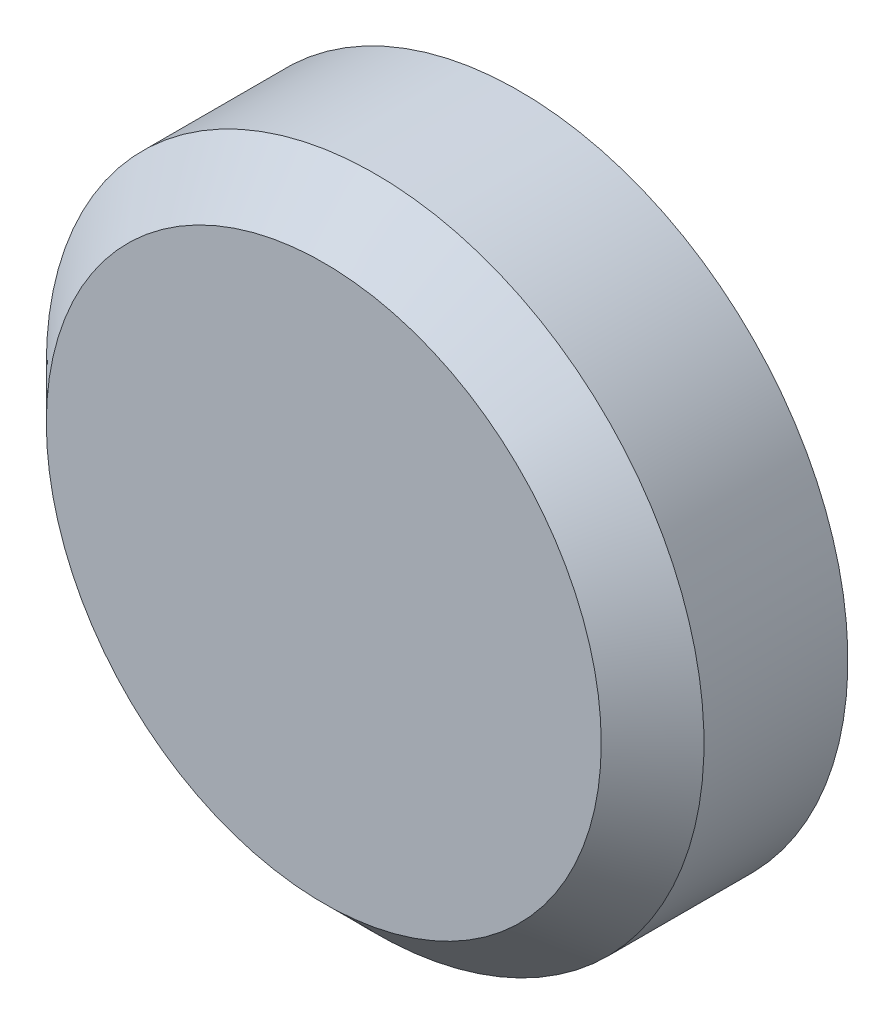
ISO-10303-21;
HEADER;
FILE_DESCRIPTION(('STEP AP214'),'2;1');
FILE_NAME('part.step','',(''),(''),'','','');
FILE_SCHEMA(('AUTOMOTIVE_DESIGN { 1 0 10303 214 1 1 1 1 }'));
ENDSEC;
DATA;
#1=APPLICATION_CONTEXT('core data for automotive mechanical design processes');
#2=APPLICATION_PROTOCOL_DEFINITION('international standard','automotive_design',2000,#1);
#3=PRODUCT_CONTEXT('',#1,'mechanical');
#4=PRODUCT('Part','Part','',(#3));
#5=PRODUCT_RELATED_PRODUCT_CATEGORY('part','',(#4));
#6=PRODUCT_DEFINITION_FORMATION('','',#4);
#7=PRODUCT_DEFINITION_CONTEXT('part definition',#1,'design');
#8=PRODUCT_DEFINITION('design','',#6,#7);
#9=PRODUCT_DEFINITION_SHAPE('','',#8);
#10=(LENGTH_UNIT() NAMED_UNIT(*) SI_UNIT(.MILLI.,.METRE.));
#11=(NAMED_UNIT(*) PLANE_ANGLE_UNIT() SI_UNIT($,.RADIAN.));
#12=(NAMED_UNIT(*) SI_UNIT($,.STERADIAN.) SOLID_ANGLE_UNIT());
#13=UNCERTAINTY_MEASURE_WITH_UNIT(LENGTH_MEASURE(1.E-05),#10,'distance_accuracy_value','');
#14=(GEOMETRIC_REPRESENTATION_CONTEXT(3) GLOBAL_UNCERTAINTY_ASSIGNED_CONTEXT((#13)) GLOBAL_UNIT_ASSIGNED_CONTEXT((#10,
#11,#12)) REPRESENTATION_CONTEXT('',''));
#15=CARTESIAN_POINT('',(0.,0.,0.));
#16=DIRECTION('',(0.,0.,1.));
#17=DIRECTION('',(1.,0.,0.));
#18=AXIS2_PLACEMENT_3D('',#15,#16,#17);
#19=CARTESIAN_POINT('',(0.,0.,1.9));
#20=DIRECTION('',(0.,0.,-1.));
#21=DIRECTION('',(-1.,0.,0.));
#22=AXIS2_PLACEMENT_3D('',#19,#20,#21);
#23=CYLINDRICAL_SURFACE('',#22,3.2);
#24=CARTESIAN_POINT('',(0.,0.,1.4));
#25=DIRECTION('',(0.,0.,1.));
#26=DIRECTION('',(1.,0.,0.));
#27=AXIS2_PLACEMENT_3D('',#24,#25,#26);
#28=CIRCLE('',#27,3.2);
#29=CARTESIAN_POINT('',(-3.2,0.,1.4));
#30=VERTEX_POINT('',#29);
#31=EDGE_CURVE('E10',#30,#30,#28,.F.);
#32=CARTESIAN_POINT('',(0.,0.,0.));
#33=DIRECTION('',(0.,0.,1.));
#34=DIRECTION('',(1.,0.,0.));
#35=AXIS2_PLACEMENT_3D('',#32,#33,#34);
#36=CIRCLE('',#35,3.2);
#37=CARTESIAN_POINT('',(-3.2,0.,0.));
#38=VERTEX_POINT('',#37);
#39=EDGE_CURVE('E41',#38,#38,#36,.T.);
#40=CARTESIAN_POINT('',(-3.2,0.,1.4));
#41=CARTESIAN_POINT('',(-3.2,0.,1.38541666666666));
#42=CARTESIAN_POINT('',(-3.2,0.,1.37083333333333));
#43=CARTESIAN_POINT('',(-3.2,0.,1.34166666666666));
#44=CARTESIAN_POINT('',(-3.2,0.,1.32708333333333));
#45=CARTESIAN_POINT('',(-3.2,0.,1.29791666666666));
#46=CARTESIAN_POINT('',(-3.2,0.,1.28333333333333));
#47=CARTESIAN_POINT('',(-3.2,0.,1.25416666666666));
#48=CARTESIAN_POINT('',(-3.2,0.,1.23958333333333));
#49=CARTESIAN_POINT('',(-3.2,0.,1.21041666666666));
#50=CARTESIAN_POINT('',(-3.2,0.,1.19583333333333));
#51=CARTESIAN_POINT('',(-3.2,0.,1.16666666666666));
#52=CARTESIAN_POINT('',(-3.2,0.,1.15208333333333));
#53=CARTESIAN_POINT('',(-3.2,0.,1.12291666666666));
#54=CARTESIAN_POINT('',(-3.2,0.,1.10833333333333));
#55=CARTESIAN_POINT('',(-3.2,0.,1.07916666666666));
#56=CARTESIAN_POINT('',(-3.2,0.,1.06458333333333));
#57=CARTESIAN_POINT('',(-3.2,0.,1.03541666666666));
#58=CARTESIAN_POINT('',(-3.2,0.,1.02083333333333));
#59=CARTESIAN_POINT('',(-3.2,0.,0.991666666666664));
#60=CARTESIAN_POINT('',(-3.2,0.,0.977083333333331));
#61=CARTESIAN_POINT('',(-3.2,0.,0.947916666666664));
#62=CARTESIAN_POINT('',(-3.2,0.,0.933333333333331));
#63=CARTESIAN_POINT('',(-3.2,0.,0.904166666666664));
#64=CARTESIAN_POINT('',(-3.2,0.,0.889583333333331));
#65=CARTESIAN_POINT('',(-3.2,0.,0.860416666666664));
#66=CARTESIAN_POINT('',(-3.2,0.,0.845833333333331));
#67=CARTESIAN_POINT('',(-3.2,0.,0.816666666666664));
#68=CARTESIAN_POINT('',(-3.2,0.,0.802083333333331));
#69=CARTESIAN_POINT('',(-3.2,0.,0.772916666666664));
#70=CARTESIAN_POINT('',(-3.2,0.,0.758333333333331));
#71=CARTESIAN_POINT('',(-3.2,0.,0.729166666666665));
#72=CARTESIAN_POINT('',(-3.2,0.,0.714583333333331));
#73=CARTESIAN_POINT('',(-3.2,0.,0.685416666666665));
#74=CARTESIAN_POINT('',(-3.2,0.,0.670833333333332));
#75=CARTESIAN_POINT('',(-3.2,0.,0.641666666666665));
#76=CARTESIAN_POINT('',(-3.2,0.,0.627083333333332));
#77=CARTESIAN_POINT('',(-3.2,0.,0.597916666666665));
#78=CARTESIAN_POINT('',(-3.2,0.,0.583333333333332));
#79=CARTESIAN_POINT('',(-3.2,0.,0.554166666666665));
#80=CARTESIAN_POINT('',(-3.2,0.,0.539583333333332));
#81=CARTESIAN_POINT('',(-3.2,0.,0.510416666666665));
#82=CARTESIAN_POINT('',(-3.2,0.,0.495833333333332));
#83=CARTESIAN_POINT('',(-3.2,0.,0.466666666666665));
#84=CARTESIAN_POINT('',(-3.2,0.,0.452083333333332));
#85=CARTESIAN_POINT('',(-3.2,0.,0.422916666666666));
#86=CARTESIAN_POINT('',(-3.2,0.,0.408333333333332));
#87=CARTESIAN_POINT('',(-3.2,0.,0.379166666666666));
#88=CARTESIAN_POINT('',(-3.2,0.,0.364583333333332));
#89=CARTESIAN_POINT('',(-3.2,0.,0.335416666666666));
#90=CARTESIAN_POINT('',(-3.2,0.,0.320833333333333));
#91=CARTESIAN_POINT('',(-3.2,0.,0.291666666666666));
#92=CARTESIAN_POINT('',(-3.2,0.,0.277083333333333));
#93=CARTESIAN_POINT('',(-3.2,0.,0.247916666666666));
#94=CARTESIAN_POINT('',(-3.2,0.,0.233333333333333));
#95=CARTESIAN_POINT('',(-3.2,0.,0.204166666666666));
#96=CARTESIAN_POINT('',(-3.2,0.,0.189583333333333));
#97=CARTESIAN_POINT('',(-3.2,0.,0.160416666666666));
#98=CARTESIAN_POINT('',(-3.2,0.,0.145833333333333));
#99=CARTESIAN_POINT('',(-3.2,0.,0.116666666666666));
#100=CARTESIAN_POINT('',(-3.2,0.,0.102083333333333));
#101=CARTESIAN_POINT('',(-3.2,0.,0.0729166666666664));
#102=CARTESIAN_POINT('',(-3.2,0.,0.0583333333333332));
#103=CARTESIAN_POINT('',(-3.2,0.,0.0291666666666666));
#104=CARTESIAN_POINT('',(-3.2,0.,0.0145833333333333));
#105=CARTESIAN_POINT('',(-3.2,0.,0.));
#106=B_SPLINE_CURVE_WITH_KNOTS('',3,(#40,#41,#42,#43,#44,#45,#46,#47,#48,#49,#50,#51,#52,#53,
#54,#55,#56,#57,#58,#59,#60,#61,#62,#63,#64,#65,#66,#67,#68,#69,#70,#71,#72,#73,#74,#75,#76,#77,
#78,#79,#80,#81,#82,#83,#84,#85,#86,#87,#88,#89,#90,#91,#92,#93,#94,#95,#96,#97,#98,#99,#100,
#101,#102,#103,#104,#105),.UNSPECIFIED.,.F.,.F.,(4,2,2,2,2,2,2,2,2,2,2,2,2,2,2,2,2,2,2,2,2,2,2,
2,2,2,2,2,2,2,2,2,4),(0.,0.04375,0.0874999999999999,0.13125,0.175,0.21875,0.262499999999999,
0.306249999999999,0.349999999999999,0.393749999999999,0.437499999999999,0.481249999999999,
0.524999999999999,0.568749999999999,0.612499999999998,0.656249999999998,0.699999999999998,
0.743749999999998,0.787499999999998,0.831249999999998,0.874999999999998,0.918749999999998,
0.962499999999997,1.00625,1.05,1.09375,1.1375,1.18125,1.225,1.26875,1.3125,1.35625,1.4),.UNSPECIFIED.);
#107=EDGE_CURVE('BSEAM31',#30,#38,#106,.T.);
#108=ORIENTED_EDGE('',*,*,#31,.T.);
#109=ORIENTED_EDGE('',*,*,#39,.T.);
#110=ORIENTED_EDGE('',*,*,#107,.T.);
#111=ORIENTED_EDGE('',*,*,#107,.F.);
#112=EDGE_LOOP('',(#108,#110,#109,#111));
#113=FACE_BOUND('',#112,.T.);
#114=ADVANCED_FACE('F31',(#113),#23,.T.);
#115=CARTESIAN_POINT('',(0.,0.,1.9));
#116=DIRECTION('',(0.,0.,1.));
#117=DIRECTION('',(1.,0.,0.));
#118=AXIS2_PLACEMENT_3D('',#115,#116,#117);
#119=PLANE('',#118);
#120=CARTESIAN_POINT('',(0.,0.,1.9));
#121=DIRECTION('',(0.,0.,1.));
#122=DIRECTION('',(1.,0.,0.));
#123=AXIS2_PLACEMENT_3D('',#120,#121,#122);
#124=CIRCLE('',#123,2.69999999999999);
#125=CARTESIAN_POINT('',(2.69999999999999,0.,1.9));
#126=VERTEX_POINT('',#125);
#127=EDGE_CURVE('E37',#126,#126,#124,.T.);
#128=ORIENTED_EDGE('',*,*,#127,.T.);
#129=EDGE_LOOP('',(#128));
#130=FACE_BOUND('',#129,.T.);
#131=ADVANCED_FACE('F52',(#130),#119,.T.);
#132=CARTESIAN_POINT('',(0.,0.,0.));
#133=DIRECTION('',(0.,0.,1.));
#134=DIRECTION('',(1.,0.,0.));
#135=AXIS2_PLACEMENT_3D('',#132,#133,#134);
#136=PLANE('',#135);
#137=ORIENTED_EDGE('',*,*,#39,.F.);
#138=EDGE_LOOP('',(#137));
#139=FACE_BOUND('',#138,.T.);
#140=ADVANCED_FACE('F49',(#139),#136,.F.);
#141=CARTESIAN_POINT('',(0.,0.,1.9));
#142=DIRECTION('',(0.,0.,-1.));
#143=DIRECTION('',(-1.,0.,0.));
#144=AXIS2_PLACEMENT_3D('',#141,#142,#143);
#145=CONICAL_SURFACE('',#144,2.69999999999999,0.785398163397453);
#146=ORIENTED_EDGE('',*,*,#31,.F.);
#147=EDGE_LOOP('',(#146));
#148=FACE_BOUND('',#147,.T.);
#149=ORIENTED_EDGE('',*,*,#127,.F.);
#150=EDGE_LOOP('',(#149));
#151=FACE_BOUND('',#150,.T.);
#152=ADVANCED_FACE('F51',(#148,#151),#145,.T.);
#153=CLOSED_SHELL('',(#114,#131,#140,#152));
#154=MANIFOLD_SOLID_BREP('B2',#153);
#155=ADVANCED_BREP_SHAPE_REPRESENTATION('',(#18,#154),#14);
#156=SHAPE_DEFINITION_REPRESENTATION(#9,#155);
ENDSEC;
END-ISO-10303-21;
